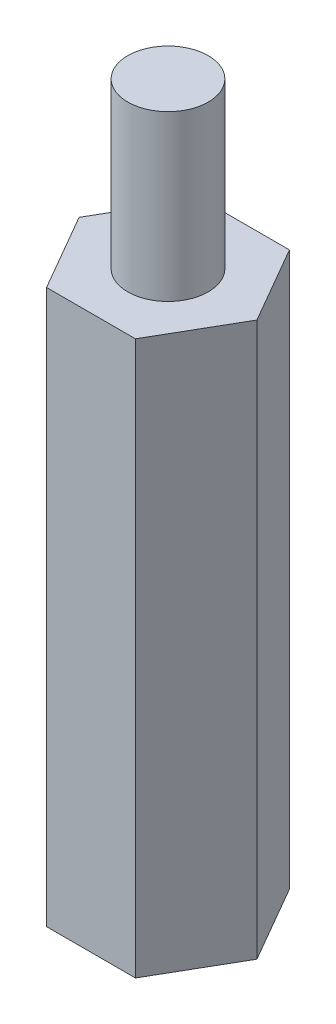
from build123d import *

# Parameters (mm, degrees)
BOSS_EXTRUDE1_DEPTH = 20.2692
SKETCH3_R           = 1.4732
BOSS_EXTRUDE2_DEPTH = 6.0198
SKETCH4_R           = 1.4732
CUT_EXTRUDE1_DEPTH  = 6.0198


with BuildPart() as part:
    # Sketch-Hex → Boss-Extrude1 (new body)
    with BuildSketch(Plane(origin=(0, 0, 0), x_dir=(1, 0, 0), z_dir=(0, 1, 0))):
        Polygon((3.255562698, 0), (1.627781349, 2.8194), (-1.627781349, 2.8194), (-3.255562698, 0), (-1.627781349, -2.8194), (1.627781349, -2.8194), align=None)
    extrude(amount=BOSS_EXTRUDE1_DEPTH)

    # Sketch3 → Boss-Extrude2 (add)
    with BuildSketch(Plane(origin=(0, 20.2692, 0), x_dir=(1, 0, 0), z_dir=(0, 1, 0))):
        with Locations(Location((0, 0, 0), (0, 0, 270))):
            Circle(SKETCH3_R)
    extrude(amount=BOSS_EXTRUDE2_DEPTH)

    # Sketch4 → Cut-Extrude1 (cut)
    with BuildSketch(Plane.XZ):
        with Locations(Location((0, 0, 0), (0, 0, 90))):
            Circle(SKETCH4_R)
    extrude(amount=-CUT_EXTRUDE1_DEPTH, mode=Mode.SUBTRACT)


solid = part.part
